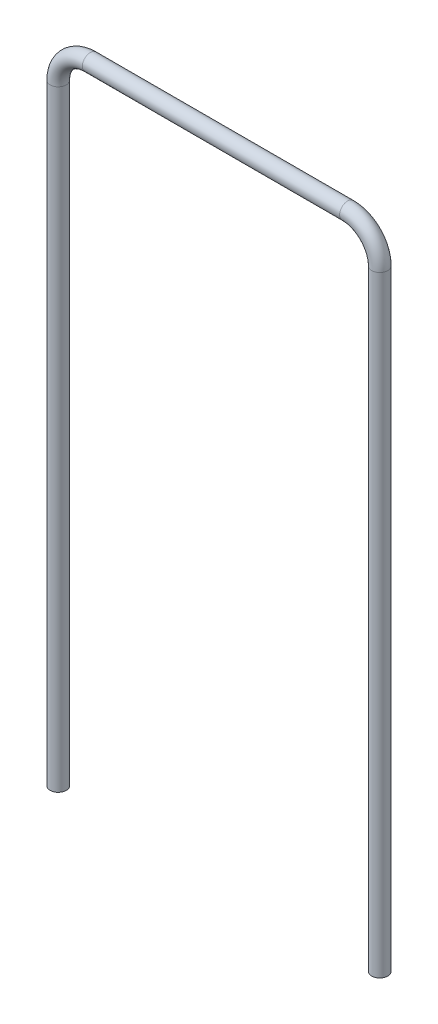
from build123d import *

# Parameters (mm, degrees)
SCHIZZO2_R = 2.5


with BuildPart() as part:
    # Sweep1: sweep along a path in Schizzo1
    with BuildLine(Plane.XY) as sweep1_path:
        Line((-50, 0), (-50, 190))
        ThreePointArc((-50, 190), (-47.071067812, 197.071067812), (-40, 200))
        Line((-40, 200), (40, 200))
        ThreePointArc((40, 200), (47.071067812, 197.071067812), (50, 190))
        Line((50, 190), (50, 0))
    # Schizzo2 → Sweep1 (sweep)
    with BuildSketch(Plane(origin=(0, 0, 0), x_dir=(1, 0, 0), z_dir=(0, 1, 0))):
        with Locations((-50, 0)):
            Circle(SCHIZZO2_R)
    sweep(path=sweep1_path.line)


solid = part.part
